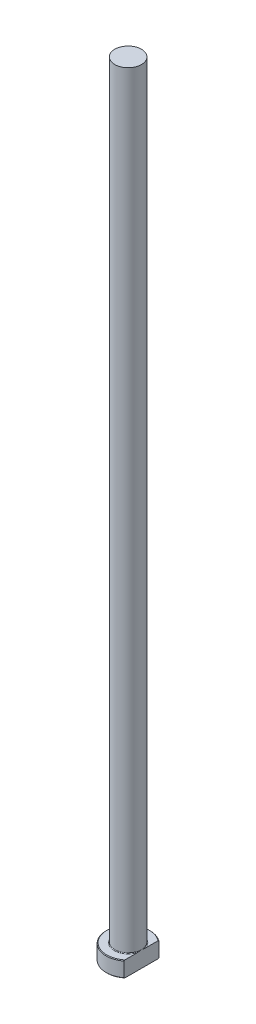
from build123d import *
from build123d.topology import SkipClean

# Parameters (mm, degrees)
CHAMFER1_SIZE = 0.2
FILLET1_R     = 0.2
KEY_DEPTH     = 251.195923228


with BuildPart() as part:
    # Sketch1 → Revolve1 (revolve)
    with BuildSketch(Plane.XY, mode=Mode.PRIVATE) as revolve1_sk:
        Polygon((0, 0), (-7, 0), (-7, 5), (-4.25, 5), (-4.25, 250), (0, 250), align=None)
    revolve(revolve1_sk.sketch.rotate(Axis((0, 259.958771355, 0), (0, -1, 0)), 270), axis=Axis((0, 259.958771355, 0), (0, -1, 0)))

    # Chamfer1
    chamfer1_edges = [part.edges().sort_by_distance(p)[0] for p in [
        (0, 5, -7),
        (0, 0, -7),
    ]]
    chamfer(chamfer1_edges, length=CHAMFER1_SIZE)

    # Fillet1
    fillet1_edges = [part.edges().sort_by_distance(p)[0] for p in [
        (0, 5, -4.25),
    ]]
    fillet(fillet1_edges, radius=FILLET1_R)

    # Sketch2 → KEY (cut, through all)
    with SkipClean():  # the faces are left unmerged after this step: merging them gives an invalid solid
        with BuildSketch(Plane(origin=(0, 0, 0), x_dir=(1, 0, 0), z_dir=(0, 1, 0))):
            with BuildLine():
                Line((4.25, 5.562148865), (4.25, -5.562148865))
                ThreePointArc((4.25, -5.562148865), (7, 0), (4.25, 5.562148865))
            make_face()
        extrude(amount=KEY_DEPTH, mode=Mode.SUBTRACT)


solid = part.part
